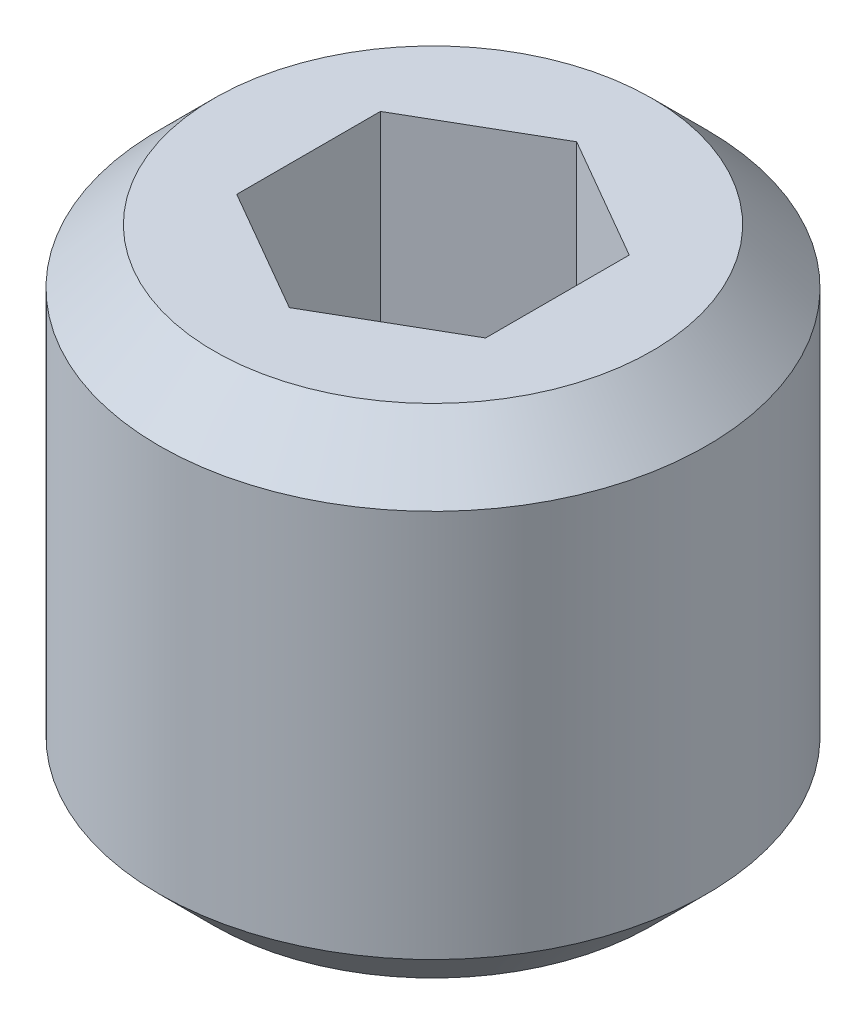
ISO-10303-21;
HEADER;
FILE_DESCRIPTION(('STEP AP214'),'2;1');
FILE_NAME('part.step','',(''),(''),'','','');
FILE_SCHEMA(('AUTOMOTIVE_DESIGN { 1 0 10303 214 1 1 1 1 }'));
ENDSEC;
DATA;
#1=APPLICATION_CONTEXT('core data for automotive mechanical design processes');
#2=APPLICATION_PROTOCOL_DEFINITION('international standard','automotive_design',2000,#1);
#3=PRODUCT_CONTEXT('',#1,'mechanical');
#4=PRODUCT('Part','Part','',(#3));
#5=PRODUCT_RELATED_PRODUCT_CATEGORY('part','',(#4));
#6=PRODUCT_DEFINITION_FORMATION('','',#4);
#7=PRODUCT_DEFINITION_CONTEXT('part definition',#1,'design');
#8=PRODUCT_DEFINITION('design','',#6,#7);
#9=PRODUCT_DEFINITION_SHAPE('','',#8);
#10=(LENGTH_UNIT() NAMED_UNIT(*) SI_UNIT(.MILLI.,.METRE.));
#11=(NAMED_UNIT(*) PLANE_ANGLE_UNIT() SI_UNIT($,.RADIAN.));
#12=(NAMED_UNIT(*) SI_UNIT($,.STERADIAN.) SOLID_ANGLE_UNIT());
#13=UNCERTAINTY_MEASURE_WITH_UNIT(LENGTH_MEASURE(1.E-05),#10,'distance_accuracy_value','');
#14=(GEOMETRIC_REPRESENTATION_CONTEXT(3) GLOBAL_UNCERTAINTY_ASSIGNED_CONTEXT((#13)) GLOBAL_UNIT_ASSIGNED_CONTEXT((#10,
#11,#12)) REPRESENTATION_CONTEXT('',''));
#15=CARTESIAN_POINT('',(0.,0.,0.));
#16=DIRECTION('',(0.,0.,1.));
#17=DIRECTION('',(1.,0.,0.));
#18=AXIS2_PLACEMENT_3D('',#15,#16,#17);
#19=CARTESIAN_POINT('',(0.,-3.,0.));
#20=DIRECTION('',(0.,1.,0.));
#21=DIRECTION('',(0.,0.,1.));
#22=AXIS2_PLACEMENT_3D('',#19,#20,#21);
#23=PLANE('',#22);
#24=CARTESIAN_POINT('',(0.,-3.,0.));
#25=DIRECTION('',(0.,1.,0.));
#26=DIRECTION('',(0.,0.,1.));
#27=AXIS2_PLACEMENT_3D('',#24,#25,#26);
#28=CIRCLE('',#27,1.32);
#29=CARTESIAN_POINT('',(0.,-3.,1.32));
#30=VERTEX_POINT('',#29);
#31=EDGE_CURVE('E473',#30,#30,#28,.F.);
#32=ORIENTED_EDGE('',*,*,#31,.T.);
#33=EDGE_LOOP('',(#32));
#34=FACE_BOUND('',#33,.T.);
#35=ADVANCED_FACE('F362',(#34),#23,.F.);
#36=CARTESIAN_POINT('',(0.,0.,0.));
#37=DIRECTION('',(0.,1.,0.));
#38=DIRECTION('',(0.,0.,1.));
#39=AXIS2_PLACEMENT_3D('',#36,#37,#38);
#40=CYLINDRICAL_SURFACE('',#39,1.65);
#41=CARTESIAN_POINT('',(0.,-0.330000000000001,0.));
#42=DIRECTION('',(0.,-1.,0.));
#43=DIRECTION('',(0.,0.,-1.));
#44=AXIS2_PLACEMENT_3D('',#41,#42,#43);
#45=CIRCLE('',#44,1.65);
#46=CARTESIAN_POINT('',(0.,-0.330000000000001,-1.65));
#47=VERTEX_POINT('',#46);
#48=EDGE_CURVE('E11',#47,#47,#45,.T.);
#49=ORIENTED_EDGE('',*,*,#48,.T.);
#50=EDGE_LOOP('',(#49));
#51=FACE_BOUND('',#50,.T.);
#52=CARTESIAN_POINT('',(0.,-2.67,0.));
#53=DIRECTION('',(0.,1.,0.));
#54=DIRECTION('',(0.,0.,1.));
#55=AXIS2_PLACEMENT_3D('',#52,#53,#54);
#56=CIRCLE('',#55,1.65);
#57=CARTESIAN_POINT('',(0.,-2.67,1.65));
#58=VERTEX_POINT('',#57);
#59=EDGE_CURVE('E464',#58,#58,#56,.T.);
#60=ORIENTED_EDGE('',*,*,#59,.T.);
#61=EDGE_LOOP('',(#60));
#62=FACE_BOUND('',#61,.T.);
#63=ADVANCED_FACE('F496',(#51,#62),#40,.T.);
#64=CARTESIAN_POINT('',(0.,0.,0.));
#65=DIRECTION('',(0.,-1.,0.));
#66=DIRECTION('',(0.,0.,-1.));
#67=AXIS2_PLACEMENT_3D('',#64,#65,#66);
#68=PLANE('',#67);
#69=DIRECTION('',(0.866025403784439,0.,-0.5));
#70=VECTOR('',#69,1.);
#71=CARTESIAN_POINT('',(0.,0.,0.866025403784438));
#72=LINE('',#71,#70);
#73=CARTESIAN_POINT('',(0.,0.,0.866025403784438));
#74=VERTEX_POINT('',#73);
#75=CARTESIAN_POINT('',(0.749999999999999,0.,0.433012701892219));
#76=VERTEX_POINT('',#75);
#77=EDGE_CURVE('E430',#74,#76,#72,.T.);
#78=ORIENTED_EDGE('',*,*,#77,.F.);
#79=DIRECTION('',(0.866025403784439,0.,0.5));
#80=VECTOR('',#79,1.);
#81=CARTESIAN_POINT('',(-0.749999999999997,0.,0.43301270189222));
#82=LINE('',#81,#80);
#83=CARTESIAN_POINT('',(-0.749999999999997,0.,0.43301270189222));
#84=VERTEX_POINT('',#83);
#85=EDGE_CURVE('E376',#84,#74,#82,.T.);
#86=ORIENTED_EDGE('',*,*,#85,.F.);
#87=DIRECTION('',(0.,0.,1.));
#88=VECTOR('',#87,1.);
#89=CARTESIAN_POINT('',(-0.749999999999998,0.,-0.433012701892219));
#90=LINE('',#89,#88);
#91=CARTESIAN_POINT('',(-0.749999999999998,0.,-0.433012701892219));
#92=VERTEX_POINT('',#91);
#93=EDGE_CURVE('E446',#92,#84,#90,.T.);
#94=ORIENTED_EDGE('',*,*,#93,.F.);
#95=DIRECTION('',(-0.866025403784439,0.,0.5));
#96=VECTOR('',#95,1.);
#97=CARTESIAN_POINT('',(0.,0.,-0.866025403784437));
#98=LINE('',#97,#96);
#99=CARTESIAN_POINT('',(0.,0.,-0.866025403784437));
#100=VERTEX_POINT('',#99);
#101=EDGE_CURVE('E440',#100,#92,#98,.T.);
#102=ORIENTED_EDGE('',*,*,#101,.F.);
#103=DIRECTION('',(-0.866025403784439,0.,-0.499999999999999));
#104=VECTOR('',#103,1.);
#105=CARTESIAN_POINT('',(0.749999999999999,0.,-0.433012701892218));
#106=LINE('',#105,#104);
#107=CARTESIAN_POINT('',(0.749999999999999,0.,-0.433012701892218));
#108=VERTEX_POINT('',#107);
#109=EDGE_CURVE('E438',#108,#100,#106,.T.);
#110=ORIENTED_EDGE('',*,*,#109,.F.);
#111=DIRECTION('',(0.,0.,-1.));
#112=VECTOR('',#111,1.);
#113=CARTESIAN_POINT('',(0.749999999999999,0.,0.433012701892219));
#114=LINE('',#113,#112);
#115=EDGE_CURVE('E419',#76,#108,#114,.T.);
#116=ORIENTED_EDGE('',*,*,#115,.F.);
#117=EDGE_LOOP('',(#78,#86,#94,#102,#110,#116));
#118=FACE_BOUND('',#117,.T.);
#119=CARTESIAN_POINT('',(0.,0.,0.));
#120=DIRECTION('',(0.,-1.,0.));
#121=DIRECTION('',(0.,0.,-1.));
#122=AXIS2_PLACEMENT_3D('',#119,#120,#121);
#123=CIRCLE('',#122,1.32);
#124=CARTESIAN_POINT('',(0.,0.,-1.32));
#125=VERTEX_POINT('',#124);
#126=EDGE_CURVE('E369',#125,#125,#123,.F.);
#127=ORIENTED_EDGE('',*,*,#126,.T.);
#128=EDGE_LOOP('',(#127));
#129=FACE_BOUND('',#128,.T.);
#130=ADVANCED_FACE('F434',(#118,#129),#68,.F.);
#131=CARTESIAN_POINT('',(0.,-2.67,0.));
#132=DIRECTION('',(0.,1.,0.));
#133=DIRECTION('',(0.,0.,1.));
#134=AXIS2_PLACEMENT_3D('',#131,#132,#133);
#135=CONICAL_SURFACE('',#134,1.65,0.785398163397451);
#136=ORIENTED_EDGE('',*,*,#31,.F.);
#137=EDGE_LOOP('',(#136));
#138=FACE_BOUND('',#137,.T.);
#139=ORIENTED_EDGE('',*,*,#59,.F.);
#140=EDGE_LOOP('',(#139));
#141=FACE_BOUND('',#140,.T.);
#142=ADVANCED_FACE('F481',(#138,#141),#135,.T.);
#143=CARTESIAN_POINT('',(0.,0.,0.));
#144=DIRECTION('',(0.,-1.,0.));
#145=DIRECTION('',(0.,0.,-1.));
#146=AXIS2_PLACEMENT_3D('',#143,#144,#145);
#147=CONICAL_SURFACE('',#146,1.32,0.785398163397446);
#148=CARTESIAN_POINT('',(0.,-0.330000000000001,-1.65));
#149=CARTESIAN_POINT('',(0.,-0.326562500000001,-1.6465625));
#150=CARTESIAN_POINT('',(0.,-0.323125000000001,-1.643125));
#151=CARTESIAN_POINT('',(0.,-0.316250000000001,-1.63625));
#152=CARTESIAN_POINT('',(0.,-0.312812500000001,-1.6328125));
#153=CARTESIAN_POINT('',(0.,-0.305937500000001,-1.6259375));
#154=CARTESIAN_POINT('',(0.,-0.302500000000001,-1.6225));
#155=CARTESIAN_POINT('',(0.,-0.295625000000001,-1.615625));
#156=CARTESIAN_POINT('',(0.,-0.292187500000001,-1.6121875));
#157=CARTESIAN_POINT('',(0.,-0.285312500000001,-1.6053125));
#158=CARTESIAN_POINT('',(0.,-0.281875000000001,-1.601875));
#159=CARTESIAN_POINT('',(0.,-0.275000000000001,-1.595));
#160=CARTESIAN_POINT('',(0.,-0.271562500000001,-1.5915625));
#161=CARTESIAN_POINT('',(0.,-0.264687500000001,-1.5846875));
#162=CARTESIAN_POINT('',(0.,-0.261250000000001,-1.58125));
#163=CARTESIAN_POINT('',(0.,-0.254375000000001,-1.574375));
#164=CARTESIAN_POINT('',(0.,-0.250937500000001,-1.5709375));
#165=CARTESIAN_POINT('',(0.,-0.244062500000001,-1.5640625));
#166=CARTESIAN_POINT('',(0.,-0.240625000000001,-1.560625));
#167=CARTESIAN_POINT('',(0.,-0.233750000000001,-1.55375));
#168=CARTESIAN_POINT('',(0.,-0.230312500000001,-1.5503125));
#169=CARTESIAN_POINT('',(0.,-0.223437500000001,-1.5434375));
#170=CARTESIAN_POINT('',(0.,-0.220000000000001,-1.54));
#171=CARTESIAN_POINT('',(0.,-0.213125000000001,-1.533125));
#172=CARTESIAN_POINT('',(0.,-0.209687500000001,-1.5296875));
#173=CARTESIAN_POINT('',(0.,-0.202812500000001,-1.5228125));
#174=CARTESIAN_POINT('',(0.,-0.199375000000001,-1.519375));
#175=CARTESIAN_POINT('',(0.,-0.192500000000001,-1.5125));
#176=CARTESIAN_POINT('',(0.,-0.189062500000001,-1.5090625));
#177=CARTESIAN_POINT('',(0.,-0.182187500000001,-1.5021875));
#178=CARTESIAN_POINT('',(0.,-0.178750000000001,-1.49875));
#179=CARTESIAN_POINT('',(0.,-0.171875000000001,-1.491875));
#180=CARTESIAN_POINT('',(0.,-0.168437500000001,-1.4884375));
#181=CARTESIAN_POINT('',(0.,-0.161562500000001,-1.4815625));
#182=CARTESIAN_POINT('',(0.,-0.158125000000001,-1.478125));
#183=CARTESIAN_POINT('',(0.,-0.151250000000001,-1.47125));
#184=CARTESIAN_POINT('',(0.,-0.147812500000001,-1.4678125));
#185=CARTESIAN_POINT('',(0.,-0.140937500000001,-1.4609375));
#186=CARTESIAN_POINT('',(0.,-0.137500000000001,-1.4575));
#187=CARTESIAN_POINT('',(0.,-0.130625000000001,-1.450625));
#188=CARTESIAN_POINT('',(0.,-0.127187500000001,-1.4471875));
#189=CARTESIAN_POINT('',(0.,-0.120312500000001,-1.4403125));
#190=CARTESIAN_POINT('',(0.,-0.116875,-1.436875));
#191=CARTESIAN_POINT('',(0.,-0.11,-1.43));
#192=CARTESIAN_POINT('',(0.,-0.1065625,-1.4265625));
#193=CARTESIAN_POINT('',(0.,-0.0996875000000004,-1.4196875));
#194=CARTESIAN_POINT('',(0.,-0.0962500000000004,-1.41625));
#195=CARTESIAN_POINT('',(0.,-0.0893750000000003,-1.409375));
#196=CARTESIAN_POINT('',(0.,-0.0859375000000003,-1.4059375));
#197=CARTESIAN_POINT('',(0.,-0.0790625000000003,-1.3990625));
#198=CARTESIAN_POINT('',(0.,-0.0756250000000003,-1.395625));
#199=CARTESIAN_POINT('',(0.,-0.0687500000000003,-1.38875));
#200=CARTESIAN_POINT('',(0.,-0.0653125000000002,-1.3853125));
#201=CARTESIAN_POINT('',(0.,-0.0584375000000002,-1.3784375));
#202=CARTESIAN_POINT('',(0.,-0.0550000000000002,-1.375));
#203=CARTESIAN_POINT('',(0.,-0.0481250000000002,-1.368125));
#204=CARTESIAN_POINT('',(0.,-0.0446875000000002,-1.3646875));
#205=CARTESIAN_POINT('',(0.,-0.0378125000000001,-1.3578125));
#206=CARTESIAN_POINT('',(0.,-0.0343750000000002,-1.354375));
#207=CARTESIAN_POINT('',(0.,-0.0275000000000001,-1.3475));
#208=CARTESIAN_POINT('',(0.,-0.0240625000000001,-1.3440625));
#209=CARTESIAN_POINT('',(0.,-0.0171875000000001,-1.3371875));
#210=CARTESIAN_POINT('',(0.,-0.0137500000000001,-1.33375));
#211=CARTESIAN_POINT('',(0.,-0.00687500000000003,-1.326875));
#212=CARTESIAN_POINT('',(0.,-0.00343750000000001,-1.3234375));
#213=CARTESIAN_POINT('',(0.,0.,-1.32));
#214=B_SPLINE_CURVE_WITH_KNOTS('',3,(#148,#149,#150,#151,#152,#153,#154,#155,#156,#157,#158,
#159,#160,#161,#162,#163,#164,#165,#166,#167,#168,#169,#170,#171,#172,#173,#174,#175,#176,#177,
#178,#179,#180,#181,#182,#183,#184,#185,#186,#187,#188,#189,#190,#191,#192,#193,#194,#195,#196,
#197,#198,#199,#200,#201,#202,#203,#204,#205,#206,#207,#208,#209,#210,#211,#212,#213),
.UNSPECIFIED.,.F.,.F.,(4,2,2,2,2,2,2,2,2,2,2,2,2,2,2,2,2,2,2,2,2,2,2,2,2,2,2,2,2,2,2,2,4),(0.,
0.0145840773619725,0.0291681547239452,0.0437522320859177,0.0583363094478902,0.0729203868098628,
0.0875044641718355,0.102088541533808,0.11667261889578,0.131256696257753,0.145840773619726,
0.160424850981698,0.175008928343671,0.189593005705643,0.204177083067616,0.218761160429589,
0.233345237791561,0.247929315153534,0.262513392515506,0.277097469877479,0.291681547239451,
0.306265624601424,0.320849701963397,0.335433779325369,0.350017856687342,0.364601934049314,
0.379186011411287,0.39377008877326,0.408354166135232,0.422938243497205,0.437522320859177,
0.45210639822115,0.466690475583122),.UNSPECIFIED.);
#215=EDGE_CURVE('BSEAM478',#47,#125,#214,.T.);
#216=ORIENTED_EDGE('',*,*,#48,.F.);
#217=ORIENTED_EDGE('',*,*,#126,.F.);
#218=ORIENTED_EDGE('',*,*,#215,.T.);
#219=ORIENTED_EDGE('',*,*,#215,.F.);
#220=EDGE_LOOP('',(#216,#218,#217,#219));
#221=FACE_BOUND('',#220,.T.);
#222=ADVANCED_FACE('F478',(#221),#147,.T.);
#223=CARTESIAN_POINT('',(-0.749999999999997,-2.5,0.43301270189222));
#224=DIRECTION('',(-0.5,0.,0.866025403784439));
#225=DIRECTION('',(0.866025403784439,0.,0.5));
#226=AXIS2_PLACEMENT_3D('',#223,#224,#225);
#227=PLANE('',#226);
#228=ORIENTED_EDGE('',*,*,#85,.T.);
#229=DIRECTION('',(0.,1.,0.));
#230=VECTOR('',#229,1.);
#231=CARTESIAN_POINT('',(0.,-2.5,0.866025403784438));
#232=LINE('',#231,#230);
#233=CARTESIAN_POINT('',(0.,-2.5,0.866025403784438));
#234=VERTEX_POINT('',#233);
#235=EDGE_CURVE('E427',#234,#74,#232,.T.);
#236=ORIENTED_EDGE('',*,*,#235,.F.);
#237=DIRECTION('',(0.866025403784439,0.,0.5));
#238=VECTOR('',#237,1.);
#239=CARTESIAN_POINT('',(-0.749999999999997,-2.5,0.43301270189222));
#240=LINE('',#239,#238);
#241=CARTESIAN_POINT('',(-0.749999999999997,-2.5,0.43301270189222));
#242=VERTEX_POINT('',#241);
#243=EDGE_CURVE('E448',#242,#234,#240,.T.);
#244=ORIENTED_EDGE('',*,*,#243,.F.);
#245=DIRECTION('',(0.,1.,0.));
#246=VECTOR('',#245,1.);
#247=CARTESIAN_POINT('',(-0.749999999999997,-2.5,0.43301270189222));
#248=LINE('',#247,#246);
#249=EDGE_CURVE('E383',#242,#84,#248,.T.);
#250=ORIENTED_EDGE('',*,*,#249,.T.);
#251=EDGE_LOOP('',(#228,#236,#244,#250));
#252=FACE_BOUND('',#251,.T.);
#253=ADVANCED_FACE('F480',(#252),#227,.F.);
#254=CARTESIAN_POINT('',(-0.749999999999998,-2.5,-0.433012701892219));
#255=DIRECTION('',(-1.,0.,0.));
#256=DIRECTION('',(0.,0.,1.));
#257=AXIS2_PLACEMENT_3D('',#254,#255,#256);
#258=PLANE('',#257);
#259=ORIENTED_EDGE('',*,*,#93,.T.);
#260=ORIENTED_EDGE('',*,*,#249,.F.);
#261=DIRECTION('',(0.,0.,1.));
#262=VECTOR('',#261,1.);
#263=CARTESIAN_POINT('',(-0.749999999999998,-2.5,-0.433012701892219));
#264=LINE('',#263,#262);
#265=CARTESIAN_POINT('',(-0.749999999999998,-2.5,-0.433012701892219));
#266=VERTEX_POINT('',#265);
#267=EDGE_CURVE('E460',#266,#242,#264,.T.);
#268=ORIENTED_EDGE('',*,*,#267,.F.);
#269=DIRECTION('',(0.,1.,0.));
#270=VECTOR('',#269,1.);
#271=CARTESIAN_POINT('',(-0.749999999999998,-2.5,-0.433012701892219));
#272=LINE('',#271,#270);
#273=EDGE_CURVE('E465',#266,#92,#272,.T.);
#274=ORIENTED_EDGE('',*,*,#273,.T.);
#275=EDGE_LOOP('',(#259,#260,#268,#274));
#276=FACE_BOUND('',#275,.T.);
#277=ADVANCED_FACE('F489',(#276),#258,.F.);
#278=CARTESIAN_POINT('',(0.,-2.5,-0.866025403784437));
#279=DIRECTION('',(-0.5,0.,-0.866025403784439));
#280=DIRECTION('',(-0.866025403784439,0.,0.5));
#281=AXIS2_PLACEMENT_3D('',#278,#279,#280);
#282=PLANE('',#281);
#283=ORIENTED_EDGE('',*,*,#101,.T.);
#284=ORIENTED_EDGE('',*,*,#273,.F.);
#285=DIRECTION('',(-0.866025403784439,0.,0.5));
#286=VECTOR('',#285,1.);
#287=CARTESIAN_POINT('',(0.,-2.5,-0.866025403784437));
#288=LINE('',#287,#286);
#289=CARTESIAN_POINT('',(0.,-2.5,-0.866025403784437));
#290=VERTEX_POINT('',#289);
#291=EDGE_CURVE('E457',#290,#266,#288,.T.);
#292=ORIENTED_EDGE('',*,*,#291,.F.);
#293=DIRECTION('',(0.,1.,0.));
#294=VECTOR('',#293,1.);
#295=CARTESIAN_POINT('',(0.,-2.5,-0.866025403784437));
#296=LINE('',#295,#294);
#297=EDGE_CURVE('E467',#290,#100,#296,.T.);
#298=ORIENTED_EDGE('',*,*,#297,.T.);
#299=EDGE_LOOP('',(#283,#284,#292,#298));
#300=FACE_BOUND('',#299,.T.);
#301=ADVANCED_FACE('F521',(#300),#282,.F.);
#302=CARTESIAN_POINT('',(0.749999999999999,-2.5,-0.433012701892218));
#303=DIRECTION('',(0.499999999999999,0.,-0.866025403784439));
#304=DIRECTION('',(-0.866025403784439,0.,-0.499999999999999));
#305=AXIS2_PLACEMENT_3D('',#302,#303,#304);
#306=PLANE('',#305);
#307=ORIENTED_EDGE('',*,*,#109,.T.);
#308=ORIENTED_EDGE('',*,*,#297,.F.);
#309=DIRECTION('',(-0.866025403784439,0.,-0.499999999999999));
#310=VECTOR('',#309,1.);
#311=CARTESIAN_POINT('',(0.749999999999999,-2.5,-0.433012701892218));
#312=LINE('',#311,#310);
#313=CARTESIAN_POINT('',(0.749999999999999,-2.5,-0.433012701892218));
#314=VERTEX_POINT('',#313);
#315=EDGE_CURVE('E454',#314,#290,#312,.T.);
#316=ORIENTED_EDGE('',*,*,#315,.F.);
#317=DIRECTION('',(0.,1.,0.));
#318=VECTOR('',#317,1.);
#319=CARTESIAN_POINT('',(0.749999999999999,-2.5,-0.433012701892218));
#320=LINE('',#319,#318);
#321=EDGE_CURVE('E426',#314,#108,#320,.T.);
#322=ORIENTED_EDGE('',*,*,#321,.T.);
#323=EDGE_LOOP('',(#307,#308,#316,#322));
#324=FACE_BOUND('',#323,.T.);
#325=ADVANCED_FACE('F528',(#324),#306,.F.);
#326=CARTESIAN_POINT('',(0.749999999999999,-2.5,0.433012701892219));
#327=DIRECTION('',(1.,0.,0.));
#328=DIRECTION('',(0.,0.,-1.));
#329=AXIS2_PLACEMENT_3D('',#326,#327,#328);
#330=PLANE('',#329);
#331=ORIENTED_EDGE('',*,*,#115,.T.);
#332=ORIENTED_EDGE('',*,*,#321,.F.);
#333=DIRECTION('',(0.,0.,-1.));
#334=VECTOR('',#333,1.);
#335=CARTESIAN_POINT('',(0.749999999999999,-2.5,0.433012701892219));
#336=LINE('',#335,#334);
#337=CARTESIAN_POINT('',(0.749999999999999,-2.5,0.433012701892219));
#338=VERTEX_POINT('',#337);
#339=EDGE_CURVE('E422',#338,#314,#336,.T.);
#340=ORIENTED_EDGE('',*,*,#339,.F.);
#341=DIRECTION('',(0.,1.,0.));
#342=VECTOR('',#341,1.);
#343=CARTESIAN_POINT('',(0.749999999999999,-2.5,0.433012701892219));
#344=LINE('',#343,#342);
#345=EDGE_CURVE('E415',#338,#76,#344,.T.);
#346=ORIENTED_EDGE('',*,*,#345,.T.);
#347=EDGE_LOOP('',(#331,#332,#340,#346));
#348=FACE_BOUND('',#347,.T.);
#349=ADVANCED_FACE('F417',(#348),#330,.F.);
#350=CARTESIAN_POINT('',(0.,-2.5,0.866025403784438));
#351=DIRECTION('',(0.5,0.,0.866025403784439));
#352=DIRECTION('',(0.866025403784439,0.,-0.5));
#353=AXIS2_PLACEMENT_3D('',#350,#351,#352);
#354=PLANE('',#353);
#355=ORIENTED_EDGE('',*,*,#77,.T.);
#356=ORIENTED_EDGE('',*,*,#345,.F.);
#357=DIRECTION('',(0.866025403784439,0.,-0.5));
#358=VECTOR('',#357,1.);
#359=CARTESIAN_POINT('',(0.,-2.5,0.866025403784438));
#360=LINE('',#359,#358);
#361=EDGE_CURVE('E451',#234,#338,#360,.T.);
#362=ORIENTED_EDGE('',*,*,#361,.F.);
#363=ORIENTED_EDGE('',*,*,#235,.T.);
#364=EDGE_LOOP('',(#355,#356,#362,#363));
#365=FACE_BOUND('',#364,.T.);
#366=ADVANCED_FACE('F431',(#365),#354,.F.);
#367=CARTESIAN_POINT('',(0.749999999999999,-2.5,1.29903810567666));
#368=DIRECTION('',(0.,1.,0.));
#369=DIRECTION('',(0.,0.,1.));
#370=AXIS2_PLACEMENT_3D('',#367,#368,#369);
#371=PLANE('',#370);
#372=ORIENTED_EDGE('',*,*,#243,.T.);
#373=ORIENTED_EDGE('',*,*,#361,.T.);
#374=ORIENTED_EDGE('',*,*,#339,.T.);
#375=ORIENTED_EDGE('',*,*,#315,.T.);
#376=ORIENTED_EDGE('',*,*,#291,.T.);
#377=ORIENTED_EDGE('',*,*,#267,.T.);
#378=EDGE_LOOP('',(#372,#373,#374,#375,#376,#377));
#379=FACE_BOUND('',#378,.T.);
#380=ADVANCED_FACE('F549',(#379),#371,.T.);
#381=CLOSED_SHELL('',(#35,#63,#130,#142,#222,#253,#277,#301,#325,#349,#366,#380));
#382=MANIFOLD_SOLID_BREP('B2',#381);
#383=ADVANCED_BREP_SHAPE_REPRESENTATION('',(#18,#382),#14);
#384=SHAPE_DEFINITION_REPRESENTATION(#9,#383);
ENDSEC;
END-ISO-10303-21;
